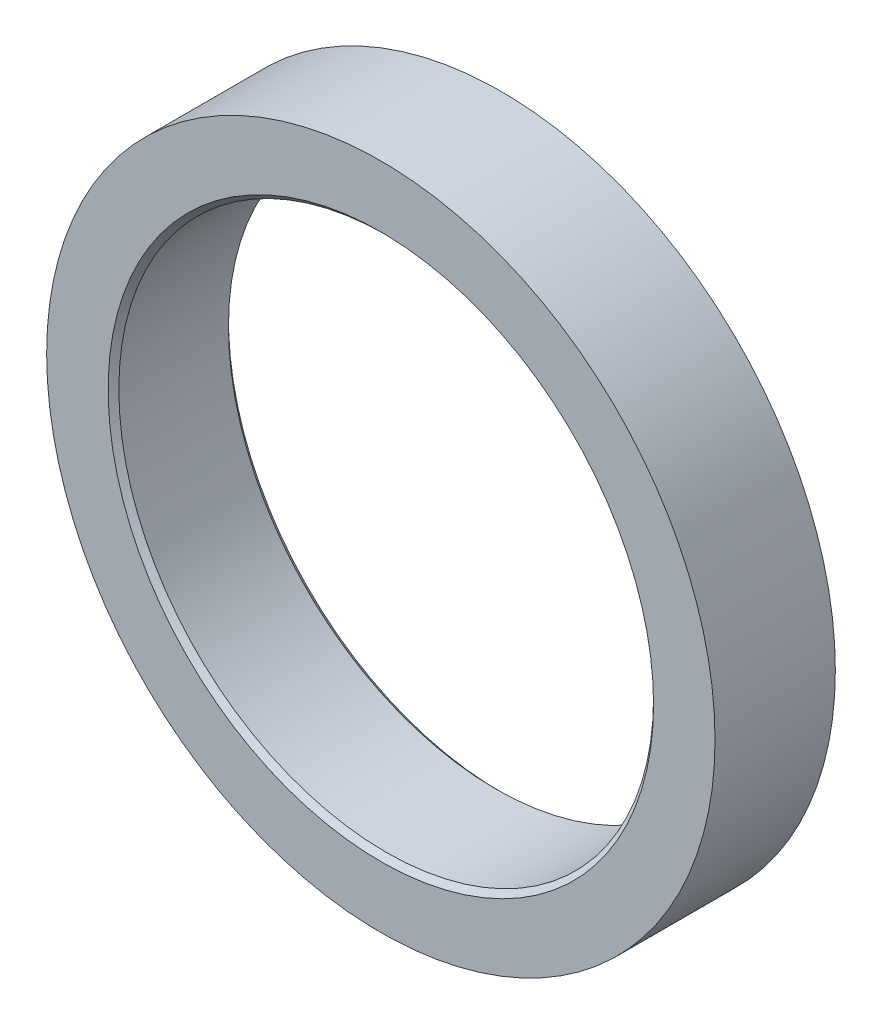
from build123d import *

# Parameters (mm, degrees)
ESQUISSE1_R      = 12.5
ESQUISSE1_R_2    = 10
EXTRUSION1_DEPTH = 4.5
CHANFREIN1_SIZE  = 0.2


with BuildPart() as part:
    # Esquisse1 → Extrusion1 (new body)
    with BuildSketch(Plane.XY):
        Circle(ESQUISSE1_R)
        Circle(ESQUISSE1_R_2, mode=Mode.SUBTRACT)
    extrude(amount=EXTRUSION1_DEPTH)

    # Chanfrein1
    chanfrein1_edges = [part.edges().sort_by_distance(p)[0] for p in [
        (-10, 0, 0),
        (-10, 0, 4.5),
    ]]
    chamfer(chanfrein1_edges, length=CHANFREIN1_SIZE)


solid = part.part
